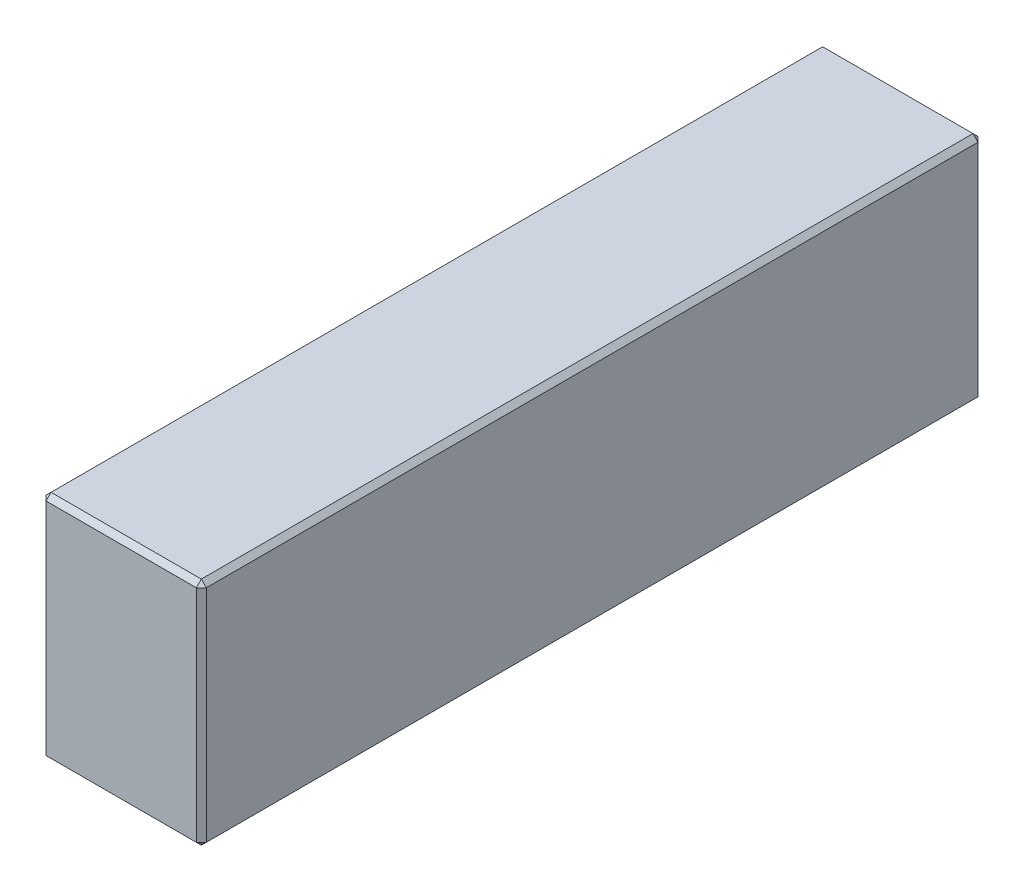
ISO-10303-21;
HEADER;
FILE_DESCRIPTION(('STEP AP214'),'2;1');
FILE_NAME('part.step','',(''),(''),'','','');
FILE_SCHEMA(('AUTOMOTIVE_DESIGN { 1 0 10303 214 1 1 1 1 }'));
ENDSEC;
DATA;
#1=APPLICATION_CONTEXT('core data for automotive mechanical design processes');
#2=APPLICATION_PROTOCOL_DEFINITION('international standard','automotive_design',2000,#1);
#3=PRODUCT_CONTEXT('',#1,'mechanical');
#4=PRODUCT('Part','Part','',(#3));
#5=PRODUCT_RELATED_PRODUCT_CATEGORY('part','',(#4));
#6=PRODUCT_DEFINITION_FORMATION('','',#4);
#7=PRODUCT_DEFINITION_CONTEXT('part definition',#1,'design');
#8=PRODUCT_DEFINITION('design','',#6,#7);
#9=PRODUCT_DEFINITION_SHAPE('','',#8);
#10=(LENGTH_UNIT() NAMED_UNIT(*) SI_UNIT(.MILLI.,.METRE.));
#11=(NAMED_UNIT(*) PLANE_ANGLE_UNIT() SI_UNIT($,.RADIAN.));
#12=(NAMED_UNIT(*) SI_UNIT($,.STERADIAN.) SOLID_ANGLE_UNIT());
#13=UNCERTAINTY_MEASURE_WITH_UNIT(LENGTH_MEASURE(1.E-05),#10,'distance_accuracy_value','');
#14=(GEOMETRIC_REPRESENTATION_CONTEXT(3) GLOBAL_UNCERTAINTY_ASSIGNED_CONTEXT((#13)) GLOBAL_UNIT_ASSIGNED_CONTEXT((#10,
#11,#12)) REPRESENTATION_CONTEXT('',''));
#15=CARTESIAN_POINT('',(0.,0.,0.));
#16=DIRECTION('',(0.,0.,1.));
#17=DIRECTION('',(1.,0.,0.));
#18=AXIS2_PLACEMENT_3D('',#15,#16,#17);
#19=CARTESIAN_POINT('',(-16.,46.,78.));
#20=DIRECTION('',(1.,0.,0.));
#21=DIRECTION('',(0.,0.,-1.));
#22=AXIS2_PLACEMENT_3D('',#19,#20,#21);
#23=PLANE('',#22);
#24=DIRECTION('',(0.,-1.,0.));
#25=VECTOR('',#24,1.);
#26=CARTESIAN_POINT('',(-16.,46.,-77.));
#27=LINE('',#26,#25);
#28=CARTESIAN_POINT('',(-16.,45.,-77.));
#29=VERTEX_POINT('',#28);
#30=CARTESIAN_POINT('',(-16.,1.,-77.));
#31=VERTEX_POINT('',#30);
#32=EDGE_CURVE('E114',#29,#31,#27,.T.);
#33=ORIENTED_EDGE('',*,*,#32,.T.);
#34=DIRECTION('',(0.,0.,1.));
#35=VECTOR('',#34,1.);
#36=CARTESIAN_POINT('',(-16.,1.,78.));
#37=LINE('',#36,#35);
#38=CARTESIAN_POINT('',(-16.,1.,77.));
#39=VERTEX_POINT('',#38);
#40=EDGE_CURVE('E110',#31,#39,#37,.T.);
#41=ORIENTED_EDGE('',*,*,#40,.T.);
#42=DIRECTION('',(0.,1.,0.));
#43=VECTOR('',#42,1.);
#44=CARTESIAN_POINT('',(-16.,46.,77.));
#45=LINE('',#44,#43);
#46=CARTESIAN_POINT('',(-16.,45.,77.));
#47=VERTEX_POINT('',#46);
#48=EDGE_CURVE('E103',#39,#47,#45,.T.);
#49=ORIENTED_EDGE('',*,*,#48,.T.);
#50=DIRECTION('',(0.,0.,-1.));
#51=VECTOR('',#50,1.);
#52=CARTESIAN_POINT('',(-16.,45.,-78.));
#53=LINE('',#52,#51);
#54=EDGE_CURVE('E107',#47,#29,#53,.T.);
#55=ORIENTED_EDGE('',*,*,#54,.T.);
#56=EDGE_LOOP('',(#33,#41,#49,#55));
#57=FACE_BOUND('',#56,.T.);
#58=ADVANCED_FACE('F15',(#57),#23,.F.);
#59=CARTESIAN_POINT('',(16.,46.,78.));
#60=DIRECTION('',(0.,0.,-1.));
#61=DIRECTION('',(-1.,0.,0.));
#62=AXIS2_PLACEMENT_3D('',#59,#60,#61);
#63=PLANE('',#62);
#64=DIRECTION('',(-1.,0.,0.));
#65=VECTOR('',#64,1.);
#66=CARTESIAN_POINT('',(-16.,45.,78.));
#67=LINE('',#66,#65);
#68=CARTESIAN_POINT('',(15.,45.,78.));
#69=VERTEX_POINT('',#68);
#70=CARTESIAN_POINT('',(-15.,45.,78.));
#71=VERTEX_POINT('',#70);
#72=EDGE_CURVE('E164',#69,#71,#67,.T.);
#73=ORIENTED_EDGE('',*,*,#72,.T.);
#74=DIRECTION('',(0.,-1.,0.));
#75=VECTOR('',#74,1.);
#76=CARTESIAN_POINT('',(-15.,46.,78.));
#77=LINE('',#76,#75);
#78=CARTESIAN_POINT('',(-15.,0.999999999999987,78.));
#79=VERTEX_POINT('',#78);
#80=EDGE_CURVE('E122',#71,#79,#77,.T.);
#81=ORIENTED_EDGE('',*,*,#80,.T.);
#82=DIRECTION('',(1.,0.,0.));
#83=VECTOR('',#82,1.);
#84=CARTESIAN_POINT('',(16.,0.999999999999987,78.));
#85=LINE('',#84,#83);
#86=CARTESIAN_POINT('',(15.,0.999999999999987,78.));
#87=VERTEX_POINT('',#86);
#88=EDGE_CURVE('E168',#79,#87,#85,.T.);
#89=ORIENTED_EDGE('',*,*,#88,.T.);
#90=DIRECTION('',(0.,1.,0.));
#91=VECTOR('',#90,1.);
#92=CARTESIAN_POINT('',(15.,46.,78.));
#93=LINE('',#92,#91);
#94=EDGE_CURVE('E166',#87,#69,#93,.T.);
#95=ORIENTED_EDGE('',*,*,#94,.T.);
#96=EDGE_LOOP('',(#73,#81,#89,#95));
#97=FACE_BOUND('',#96,.T.);
#98=ADVANCED_FACE('F275',(#97),#63,.F.);
#99=CARTESIAN_POINT('',(16.,46.,78.));
#100=DIRECTION('',(-1.,0.,0.));
#101=DIRECTION('',(0.,0.,1.));
#102=AXIS2_PLACEMENT_3D('',#99,#100,#101);
#103=PLANE('',#102);
#104=DIRECTION('',(0.,0.,-1.));
#105=VECTOR('',#104,1.);
#106=CARTESIAN_POINT('',(16.,0.999999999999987,78.));
#107=LINE('',#106,#105);
#108=CARTESIAN_POINT('',(16.,0.999999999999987,77.));
#109=VERTEX_POINT('',#108);
#110=CARTESIAN_POINT('',(16.,0.999999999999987,-77.));
#111=VERTEX_POINT('',#110);
#112=EDGE_CURVE('E159',#109,#111,#107,.T.);
#113=ORIENTED_EDGE('',*,*,#112,.T.);
#114=DIRECTION('',(0.,1.,0.));
#115=VECTOR('',#114,1.);
#116=CARTESIAN_POINT('',(16.,46.,-77.));
#117=LINE('',#116,#115);
#118=CARTESIAN_POINT('',(16.,45.,-77.));
#119=VERTEX_POINT('',#118);
#120=EDGE_CURVE('E161',#111,#119,#117,.T.);
#121=ORIENTED_EDGE('',*,*,#120,.T.);
#122=DIRECTION('',(0.,0.,1.));
#123=VECTOR('',#122,1.);
#124=CARTESIAN_POINT('',(16.,45.,78.));
#125=LINE('',#124,#123);
#126=CARTESIAN_POINT('',(16.,45.,77.));
#127=VERTEX_POINT('',#126);
#128=EDGE_CURVE('E155',#119,#127,#125,.T.);
#129=ORIENTED_EDGE('',*,*,#128,.T.);
#130=DIRECTION('',(0.,-1.,0.));
#131=VECTOR('',#130,1.);
#132=CARTESIAN_POINT('',(16.,46.,77.));
#133=LINE('',#132,#131);
#134=EDGE_CURVE('E157',#127,#109,#133,.T.);
#135=ORIENTED_EDGE('',*,*,#134,.T.);
#136=EDGE_LOOP('',(#113,#121,#129,#135));
#137=FACE_BOUND('',#136,.T.);
#138=ADVANCED_FACE('F254',(#137),#103,.F.);
#139=CARTESIAN_POINT('',(16.,46.,-78.));
#140=DIRECTION('',(0.,0.,1.));
#141=DIRECTION('',(1.,0.,0.));
#142=AXIS2_PLACEMENT_3D('',#139,#140,#141);
#143=PLANE('',#142);
#144=DIRECTION('',(0.,-1.,0.));
#145=VECTOR('',#144,1.);
#146=CARTESIAN_POINT('',(15.,46.,-78.));
#147=LINE('',#146,#145);
#148=CARTESIAN_POINT('',(15.,45.,-78.));
#149=VERTEX_POINT('',#148);
#150=CARTESIAN_POINT('',(15.,0.999999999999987,-78.));
#151=VERTEX_POINT('',#150);
#152=EDGE_CURVE('E148',#149,#151,#147,.T.);
#153=ORIENTED_EDGE('',*,*,#152,.T.);
#154=DIRECTION('',(-1.,0.,0.));
#155=VECTOR('',#154,1.);
#156=CARTESIAN_POINT('',(16.,0.999999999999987,-78.));
#157=LINE('',#156,#155);
#158=CARTESIAN_POINT('',(-15.,0.999999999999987,-78.));
#159=VERTEX_POINT('',#158);
#160=EDGE_CURVE('E153',#151,#159,#157,.T.);
#161=ORIENTED_EDGE('',*,*,#160,.T.);
#162=DIRECTION('',(0.,1.,0.));
#163=VECTOR('',#162,1.);
#164=CARTESIAN_POINT('',(-15.,46.,-78.));
#165=LINE('',#164,#163);
#166=CARTESIAN_POINT('',(-15.,45.,-78.));
#167=VERTEX_POINT('',#166);
#168=EDGE_CURVE('E150',#159,#167,#165,.T.);
#169=ORIENTED_EDGE('',*,*,#168,.T.);
#170=DIRECTION('',(1.,0.,0.));
#171=VECTOR('',#170,1.);
#172=CARTESIAN_POINT('',(16.,45.,-78.));
#173=LINE('',#172,#171);
#174=EDGE_CURVE('E146',#167,#149,#173,.T.);
#175=ORIENTED_EDGE('',*,*,#174,.T.);
#176=EDGE_LOOP('',(#153,#161,#169,#175));
#177=FACE_BOUND('',#176,.T.);
#178=ADVANCED_FACE('F284',(#177),#143,.F.);
#179=CARTESIAN_POINT('',(0.,46.,0.));
#180=DIRECTION('',(0.,1.,0.));
#181=DIRECTION('',(0.,0.,1.));
#182=AXIS2_PLACEMENT_3D('',#179,#180,#181);
#183=PLANE('',#182);
#184=DIRECTION('',(0.,0.,-1.));
#185=VECTOR('',#184,1.);
#186=CARTESIAN_POINT('',(15.,46.,-78.));
#187=LINE('',#186,#185);
#188=CARTESIAN_POINT('',(15.,46.,77.));
#189=VERTEX_POINT('',#188);
#190=CARTESIAN_POINT('',(15.,46.,-77.));
#191=VERTEX_POINT('',#190);
#192=EDGE_CURVE('E24',#189,#191,#187,.T.);
#193=ORIENTED_EDGE('',*,*,#192,.T.);
#194=DIRECTION('',(-1.,0.,0.));
#195=VECTOR('',#194,1.);
#196=CARTESIAN_POINT('',(-16.,46.,-77.));
#197=LINE('',#196,#195);
#198=CARTESIAN_POINT('',(-15.,46.,-77.));
#199=VERTEX_POINT('',#198);
#200=EDGE_CURVE('E9',#191,#199,#197,.T.);
#201=ORIENTED_EDGE('',*,*,#200,.T.);
#202=DIRECTION('',(0.,0.,1.));
#203=VECTOR('',#202,1.);
#204=CARTESIAN_POINT('',(-15.,46.,78.));
#205=LINE('',#204,#203);
#206=CARTESIAN_POINT('',(-15.,46.,77.));
#207=VERTEX_POINT('',#206);
#208=EDGE_CURVE('E180',#199,#207,#205,.T.);
#209=ORIENTED_EDGE('',*,*,#208,.T.);
#210=DIRECTION('',(1.,0.,0.));
#211=VECTOR('',#210,1.);
#212=CARTESIAN_POINT('',(16.,46.,77.));
#213=LINE('',#212,#211);
#214=EDGE_CURVE('E35',#207,#189,#213,.T.);
#215=ORIENTED_EDGE('',*,*,#214,.T.);
#216=EDGE_LOOP('',(#193,#201,#209,#215));
#217=FACE_BOUND('',#216,.T.);
#218=ADVANCED_FACE('F350',(#217),#183,.T.);
#219=CARTESIAN_POINT('',(0.,0.,0.));
#220=DIRECTION('',(0.,1.,0.));
#221=DIRECTION('',(0.,0.,1.));
#222=AXIS2_PLACEMENT_3D('',#219,#220,#221);
#223=PLANE('',#222);
#224=DIRECTION('',(0.,0.,1.));
#225=VECTOR('',#224,1.);
#226=CARTESIAN_POINT('',(15.,0.,0.));
#227=LINE('',#226,#225);
#228=CARTESIAN_POINT('',(15.,0.,-77.));
#229=VERTEX_POINT('',#228);
#230=CARTESIAN_POINT('',(15.,0.,77.));
#231=VERTEX_POINT('',#230);
#232=EDGE_CURVE('E171',#229,#231,#227,.T.);
#233=ORIENTED_EDGE('',*,*,#232,.T.);
#234=DIRECTION('',(-1.,0.,0.));
#235=VECTOR('',#234,1.);
#236=CARTESIAN_POINT('',(0.,0.,77.));
#237=LINE('',#236,#235);
#238=CARTESIAN_POINT('',(-15.,0.,77.));
#239=VERTEX_POINT('',#238);
#240=EDGE_CURVE('E177',#231,#239,#237,.T.);
#241=ORIENTED_EDGE('',*,*,#240,.T.);
#242=DIRECTION('',(0.,0.,-1.));
#243=VECTOR('',#242,1.);
#244=CARTESIAN_POINT('',(-15.,0.,0.));
#245=LINE('',#244,#243);
#246=CARTESIAN_POINT('',(-15.,0.,-77.));
#247=VERTEX_POINT('',#246);
#248=EDGE_CURVE('E175',#239,#247,#245,.T.);
#249=ORIENTED_EDGE('',*,*,#248,.T.);
#250=DIRECTION('',(1.,0.,0.));
#251=VECTOR('',#250,1.);
#252=CARTESIAN_POINT('',(0.,0.,-77.));
#253=LINE('',#252,#251);
#254=EDGE_CURVE('E173',#247,#229,#253,.T.);
#255=ORIENTED_EDGE('',*,*,#254,.T.);
#256=EDGE_LOOP('',(#233,#241,#249,#255));
#257=FACE_BOUND('',#256,.T.);
#258=ADVANCED_FACE('F246',(#257),#223,.F.);
#259=CARTESIAN_POINT('',(16.,46.,77.));
#260=DIRECTION('',(-0.707106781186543,0.,-0.707106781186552));
#261=DIRECTION('',(0.,-1.,0.));
#262=AXIS2_PLACEMENT_3D('',#259,#260,#261);
#263=PLANE('',#262);
#264=DIRECTION('',(-0.707106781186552,0.,0.707106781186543));
#265=VECTOR('',#264,1.);
#266=CARTESIAN_POINT('',(15.,45.,78.));
#267=LINE('',#266,#265);
#268=EDGE_CURVE('E19',#69,#127,#267,.F.);
#269=ORIENTED_EDGE('',*,*,#268,.F.);
#270=ORIENTED_EDGE('',*,*,#94,.F.);
#271=DIRECTION('',(0.707106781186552,0.,-0.707106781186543));
#272=VECTOR('',#271,1.);
#273=CARTESIAN_POINT('',(15.,0.999999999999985,78.));
#274=LINE('',#273,#272);
#275=EDGE_CURVE('E142',#109,#87,#274,.F.);
#276=ORIENTED_EDGE('',*,*,#275,.F.);
#277=ORIENTED_EDGE('',*,*,#134,.F.);
#278=EDGE_LOOP('',(#269,#270,#276,#277));
#279=FACE_BOUND('',#278,.T.);
#280=ADVANCED_FACE('F17',(#279),#263,.F.);
#281=CARTESIAN_POINT('',(15.,45.,78.));
#282=DIRECTION('',(0.577350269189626,0.577350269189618,0.577350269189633));
#283=DIRECTION('',(0.707106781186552,0.,-0.707106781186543));
#284=AXIS2_PLACEMENT_3D('',#281,#282,#283);
#285=PLANE('',#284);
#286=DIRECTION('',(0.,-0.707106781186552,0.707106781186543));
#287=VECTOR('',#286,1.);
#288=CARTESIAN_POINT('',(15.,45.,78.));
#289=LINE('',#288,#287);
#290=EDGE_CURVE('E226',#69,#189,#289,.F.);
#291=ORIENTED_EDGE('',*,*,#290,.F.);
#292=ORIENTED_EDGE('',*,*,#268,.T.);
#293=DIRECTION('',(-0.707106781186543,0.707106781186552,0.));
#294=VECTOR('',#293,1.);
#295=CARTESIAN_POINT('',(15.5,45.5,77.));
#296=LINE('',#295,#294);
#297=EDGE_CURVE('E228',#189,#127,#296,.F.);
#298=ORIENTED_EDGE('',*,*,#297,.F.);
#299=EDGE_LOOP('',(#291,#292,#298));
#300=FACE_BOUND('',#299,.T.);
#301=ADVANCED_FACE('F270',(#300),#285,.T.);
#302=CARTESIAN_POINT('',(15.,0.999999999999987,78.));
#303=DIRECTION('',(0.577350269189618,-0.577350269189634,0.577350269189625));
#304=DIRECTION('',(0.,-0.707106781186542,-0.707106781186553));
#305=AXIS2_PLACEMENT_3D('',#302,#303,#304);
#306=PLANE('',#305);
#307=DIRECTION('',(-0.707106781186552,-0.707106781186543,0.));
#308=VECTOR('',#307,1.);
#309=CARTESIAN_POINT('',(15.5,0.499999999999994,77.));
#310=LINE('',#309,#308);
#311=EDGE_CURVE('E220',#109,#231,#310,.T.);
#312=ORIENTED_EDGE('',*,*,#311,.F.);
#313=ORIENTED_EDGE('',*,*,#275,.T.);
#314=DIRECTION('',(0.,0.707106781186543,0.707106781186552));
#315=VECTOR('',#314,1.);
#316=CARTESIAN_POINT('',(15.,0.999999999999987,78.));
#317=LINE('',#316,#315);
#318=EDGE_CURVE('E223',#231,#87,#317,.T.);
#319=ORIENTED_EDGE('',*,*,#318,.F.);
#320=EDGE_LOOP('',(#312,#313,#319));
#321=FACE_BOUND('',#320,.T.);
#322=ADVANCED_FACE('F235',(#321),#306,.T.);
#323=CARTESIAN_POINT('',(15.,46.,0.));
#324=DIRECTION('',(0.707106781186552,0.707106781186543,0.));
#325=DIRECTION('',(0.,0.,1.));
#326=AXIS2_PLACEMENT_3D('',#323,#324,#325);
#327=PLANE('',#326);
#328=ORIENTED_EDGE('',*,*,#297,.T.);
#329=ORIENTED_EDGE('',*,*,#128,.F.);
#330=DIRECTION('',(0.707106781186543,-0.707106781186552,0.));
#331=VECTOR('',#330,1.);
#332=CARTESIAN_POINT('',(16.,45.,-77.));
#333=LINE('',#332,#331);
#334=EDGE_CURVE('E215',#191,#119,#333,.T.);
#335=ORIENTED_EDGE('',*,*,#334,.F.);
#336=ORIENTED_EDGE('',*,*,#192,.F.);
#337=EDGE_LOOP('',(#328,#329,#335,#336));
#338=FACE_BOUND('',#337,.T.);
#339=ADVANCED_FACE('F265',(#338),#327,.T.);
#340=CARTESIAN_POINT('',(0.,46.,77.));
#341=DIRECTION('',(0.,0.707106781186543,0.707106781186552));
#342=DIRECTION('',(-1.,0.,0.));
#343=AXIS2_PLACEMENT_3D('',#340,#341,#342);
#344=PLANE('',#343);
#345=ORIENTED_EDGE('',*,*,#290,.T.);
#346=ORIENTED_EDGE('',*,*,#214,.F.);
#347=DIRECTION('',(0.,0.707106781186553,-0.707106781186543));
#348=VECTOR('',#347,1.);
#349=CARTESIAN_POINT('',(-15.,45.5,77.5));
#350=LINE('',#349,#348);
#351=EDGE_CURVE('E126',#71,#207,#350,.T.);
#352=ORIENTED_EDGE('',*,*,#351,.F.);
#353=ORIENTED_EDGE('',*,*,#72,.F.);
#354=EDGE_LOOP('',(#345,#346,#352,#353));
#355=FACE_BOUND('',#354,.T.);
#356=ADVANCED_FACE('F273',(#355),#344,.T.);
#357=CARTESIAN_POINT('',(-15.,46.,78.));
#358=DIRECTION('',(0.707106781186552,0.,-0.707106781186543));
#359=DIRECTION('',(0.,-1.,0.));
#360=AXIS2_PLACEMENT_3D('',#357,#358,#359);
#361=PLANE('',#360);
#362=DIRECTION('',(0.707106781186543,0.,0.707106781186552));
#363=VECTOR('',#362,1.);
#364=CARTESIAN_POINT('',(-15.,0.999999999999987,78.));
#365=LINE('',#364,#363);
#366=EDGE_CURVE('E127',#79,#39,#365,.F.);
#367=ORIENTED_EDGE('',*,*,#366,.F.);
#368=ORIENTED_EDGE('',*,*,#80,.F.);
#369=DIRECTION('',(-0.707106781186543,0.,-0.707106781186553));
#370=VECTOR('',#369,1.);
#371=CARTESIAN_POINT('',(-16.,45.,77.));
#372=LINE('',#371,#370);
#373=EDGE_CURVE('E118',#47,#71,#372,.F.);
#374=ORIENTED_EDGE('',*,*,#373,.F.);
#375=ORIENTED_EDGE('',*,*,#48,.F.);
#376=EDGE_LOOP('',(#367,#368,#374,#375));
#377=FACE_BOUND('',#376,.T.);
#378=ADVANCED_FACE('F120',(#377),#361,.F.);
#379=CARTESIAN_POINT('',(16.,0.999999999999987,78.));
#380=DIRECTION('',(0.,0.707106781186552,-0.707106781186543));
#381=DIRECTION('',(1.,0.,0.));
#382=AXIS2_PLACEMENT_3D('',#379,#380,#381);
#383=PLANE('',#382);
#384=ORIENTED_EDGE('',*,*,#318,.T.);
#385=ORIENTED_EDGE('',*,*,#88,.F.);
#386=DIRECTION('',(0.,-0.707106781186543,-0.707106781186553));
#387=VECTOR('',#386,1.);
#388=CARTESIAN_POINT('',(-15.,0.999999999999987,78.));
#389=LINE('',#388,#387);
#390=EDGE_CURVE('E211',#239,#79,#389,.F.);
#391=ORIENTED_EDGE('',*,*,#390,.F.);
#392=ORIENTED_EDGE('',*,*,#240,.F.);
#393=EDGE_LOOP('',(#384,#385,#391,#392));
#394=FACE_BOUND('',#393,.T.);
#395=ADVANCED_FACE('F243',(#394),#383,.F.);
#396=CARTESIAN_POINT('',(16.,0.999999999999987,78.));
#397=DIRECTION('',(-0.707106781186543,0.707106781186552,0.));
#398=DIRECTION('',(0.,0.,-1.));
#399=AXIS2_PLACEMENT_3D('',#396,#397,#398);
#400=PLANE('',#399);
#401=ORIENTED_EDGE('',*,*,#311,.T.);
#402=ORIENTED_EDGE('',*,*,#232,.F.);
#403=DIRECTION('',(0.707106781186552,0.707106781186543,0.));
#404=VECTOR('',#403,1.);
#405=CARTESIAN_POINT('',(15.5,0.5,-77.));
#406=LINE('',#405,#404);
#407=EDGE_CURVE('E208',#111,#229,#406,.F.);
#408=ORIENTED_EDGE('',*,*,#407,.F.);
#409=ORIENTED_EDGE('',*,*,#112,.F.);
#410=EDGE_LOOP('',(#401,#402,#408,#409));
#411=FACE_BOUND('',#410,.T.);
#412=ADVANCED_FACE('F251',(#411),#400,.F.);
#413=CARTESIAN_POINT('',(15.,46.,-78.));
#414=DIRECTION('',(-0.707106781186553,0.,0.707106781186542));
#415=DIRECTION('',(0.,-1.,0.));
#416=AXIS2_PLACEMENT_3D('',#413,#414,#415);
#417=PLANE('',#416);
#418=DIRECTION('',(0.707106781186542,0.,0.707106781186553));
#419=VECTOR('',#418,1.);
#420=CARTESIAN_POINT('',(16.,45.,-77.));
#421=LINE('',#420,#419);
#422=EDGE_CURVE('E217',#119,#149,#421,.F.);
#423=ORIENTED_EDGE('',*,*,#422,.F.);
#424=ORIENTED_EDGE('',*,*,#120,.F.);
#425=DIRECTION('',(-0.707106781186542,0.,-0.707106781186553));
#426=VECTOR('',#425,1.);
#427=CARTESIAN_POINT('',(15.,0.999999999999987,-78.));
#428=LINE('',#427,#426);
#429=EDGE_CURVE('E205',#151,#111,#428,.F.);
#430=ORIENTED_EDGE('',*,*,#429,.F.);
#431=ORIENTED_EDGE('',*,*,#152,.F.);
#432=EDGE_LOOP('',(#423,#424,#430,#431));
#433=FACE_BOUND('',#432,.T.);
#434=ADVANCED_FACE('F258',(#433),#417,.F.);
#435=CARTESIAN_POINT('',(16.,45.,-77.));
#436=DIRECTION('',(0.577350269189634,0.577350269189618,-0.577350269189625));
#437=DIRECTION('',(-0.707106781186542,0.,-0.707106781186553));
#438=AXIS2_PLACEMENT_3D('',#435,#436,#437);
#439=PLANE('',#438);
#440=ORIENTED_EDGE('',*,*,#334,.T.);
#441=ORIENTED_EDGE('',*,*,#422,.T.);
#442=DIRECTION('',(0.,0.707106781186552,0.707106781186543));
#443=VECTOR('',#442,1.);
#444=CARTESIAN_POINT('',(15.,45.5,-77.5));
#445=LINE('',#444,#443);
#446=EDGE_CURVE('E134',#191,#149,#445,.F.);
#447=ORIENTED_EDGE('',*,*,#446,.F.);
#448=EDGE_LOOP('',(#440,#441,#447));
#449=FACE_BOUND('',#448,.T.);
#450=ADVANCED_FACE('F325',(#449),#439,.T.);
#451=CARTESIAN_POINT('',(-16.,45.,77.));
#452=DIRECTION('',(-0.577350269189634,0.577350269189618,0.577350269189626));
#453=DIRECTION('',(0.707106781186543,0.,0.707106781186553));
#454=AXIS2_PLACEMENT_3D('',#451,#452,#453);
#455=PLANE('',#454);
#456=ORIENTED_EDGE('',*,*,#373,.T.);
#457=ORIENTED_EDGE('',*,*,#351,.T.);
#458=DIRECTION('',(-0.707106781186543,-0.707106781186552,0.));
#459=VECTOR('',#458,1.);
#460=CARTESIAN_POINT('',(-16.,45.,77.));
#461=LINE('',#460,#459);
#462=EDGE_CURVE('E130',#47,#207,#461,.F.);
#463=ORIENTED_EDGE('',*,*,#462,.F.);
#464=EDGE_LOOP('',(#456,#457,#463));
#465=FACE_BOUND('',#464,.T.);
#466=ADVANCED_FACE('F131',(#465),#455,.T.);
#467=CARTESIAN_POINT('',(-15.,0.999999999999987,78.));
#468=DIRECTION('',(-0.577350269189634,-0.577350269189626,0.577350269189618));
#469=DIRECTION('',(0.707106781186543,-0.707106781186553,0.));
#470=AXIS2_PLACEMENT_3D('',#467,#468,#469);
#471=PLANE('',#470);
#472=ORIENTED_EDGE('',*,*,#390,.T.);
#473=ORIENTED_EDGE('',*,*,#366,.T.);
#474=DIRECTION('',(-0.707106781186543,0.707106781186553,0.));
#475=VECTOR('',#474,1.);
#476=CARTESIAN_POINT('',(-15.5,0.5,77.));
#477=LINE('',#476,#475);
#478=EDGE_CURVE('E135',#239,#39,#477,.T.);
#479=ORIENTED_EDGE('',*,*,#478,.F.);
#480=EDGE_LOOP('',(#472,#473,#479));
#481=FACE_BOUND('',#480,.T.);
#482=ADVANCED_FACE('F318',(#481),#471,.T.);
#483=CARTESIAN_POINT('',(15.,0.999999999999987,-78.));
#484=DIRECTION('',(0.577350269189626,-0.577350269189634,-0.577350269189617));
#485=DIRECTION('',(0.707106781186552,0.707106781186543,0.));
#486=AXIS2_PLACEMENT_3D('',#483,#484,#485);
#487=PLANE('',#486);
#488=ORIENTED_EDGE('',*,*,#429,.T.);
#489=ORIENTED_EDGE('',*,*,#407,.T.);
#490=DIRECTION('',(0.,-0.707106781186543,0.707106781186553));
#491=VECTOR('',#490,1.);
#492=CARTESIAN_POINT('',(15.,0.999999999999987,-78.));
#493=LINE('',#492,#491);
#494=EDGE_CURVE('E198',#151,#229,#493,.T.);
#495=ORIENTED_EDGE('',*,*,#494,.F.);
#496=EDGE_LOOP('',(#488,#489,#495));
#497=FACE_BOUND('',#496,.T.);
#498=ADVANCED_FACE('F314',(#497),#487,.T.);
#499=CARTESIAN_POINT('',(0.,46.,-77.));
#500=DIRECTION('',(0.,0.707106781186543,-0.707106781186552));
#501=DIRECTION('',(1.,0.,0.));
#502=AXIS2_PLACEMENT_3D('',#499,#500,#501);
#503=PLANE('',#502);
#504=ORIENTED_EDGE('',*,*,#446,.T.);
#505=ORIENTED_EDGE('',*,*,#174,.F.);
#506=DIRECTION('',(0.,-0.707106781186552,-0.707106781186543));
#507=VECTOR('',#506,1.);
#508=CARTESIAN_POINT('',(-15.,45.,-78.));
#509=LINE('',#508,#507);
#510=EDGE_CURVE('E195',#199,#167,#509,.T.);
#511=ORIENTED_EDGE('',*,*,#510,.F.);
#512=ORIENTED_EDGE('',*,*,#200,.F.);
#513=EDGE_LOOP('',(#504,#505,#511,#512));
#514=FACE_BOUND('',#513,.T.);
#515=ADVANCED_FACE('F311',(#514),#503,.T.);
#516=CARTESIAN_POINT('',(-15.,46.,0.));
#517=DIRECTION('',(-0.707106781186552,0.707106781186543,0.));
#518=DIRECTION('',(0.,0.,-1.));
#519=AXIS2_PLACEMENT_3D('',#516,#517,#518);
#520=PLANE('',#519);
#521=ORIENTED_EDGE('',*,*,#462,.T.);
#522=ORIENTED_EDGE('',*,*,#208,.F.);
#523=DIRECTION('',(0.707106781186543,0.707106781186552,0.));
#524=VECTOR('',#523,1.);
#525=CARTESIAN_POINT('',(-15.5,45.5,-77.));
#526=LINE('',#525,#524);
#527=EDGE_CURVE('E138',#29,#199,#526,.T.);
#528=ORIENTED_EDGE('',*,*,#527,.F.);
#529=ORIENTED_EDGE('',*,*,#54,.F.);
#530=EDGE_LOOP('',(#521,#522,#528,#529));
#531=FACE_BOUND('',#530,.T.);
#532=ADVANCED_FACE('F137',(#531),#520,.T.);
#533=CARTESIAN_POINT('',(-16.,1.,78.));
#534=DIRECTION('',(0.707106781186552,0.707106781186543,0.));
#535=DIRECTION('',(0.,0.,1.));
#536=AXIS2_PLACEMENT_3D('',#533,#534,#535);
#537=PLANE('',#536);
#538=ORIENTED_EDGE('',*,*,#478,.T.);
#539=ORIENTED_EDGE('',*,*,#40,.F.);
#540=DIRECTION('',(0.707106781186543,-0.707106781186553,0.));
#541=VECTOR('',#540,1.);
#542=CARTESIAN_POINT('',(-16.,1.,-77.));
#543=LINE('',#542,#541);
#544=EDGE_CURVE('E191',#247,#31,#543,.F.);
#545=ORIENTED_EDGE('',*,*,#544,.F.);
#546=ORIENTED_EDGE('',*,*,#248,.F.);
#547=EDGE_LOOP('',(#538,#539,#545,#546));
#548=FACE_BOUND('',#547,.T.);
#549=ADVANCED_FACE('F304',(#548),#537,.F.);
#550=CARTESIAN_POINT('',(16.,0.999999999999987,-78.));
#551=DIRECTION('',(0.,0.707106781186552,0.707106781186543));
#552=DIRECTION('',(-1.,0.,0.));
#553=AXIS2_PLACEMENT_3D('',#550,#551,#552);
#554=PLANE('',#553);
#555=ORIENTED_EDGE('',*,*,#494,.T.);
#556=ORIENTED_EDGE('',*,*,#254,.F.);
#557=DIRECTION('',(0.,0.707106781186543,-0.707106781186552));
#558=VECTOR('',#557,1.);
#559=CARTESIAN_POINT('',(-15.,0.499999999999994,-77.5));
#560=LINE('',#559,#558);
#561=EDGE_CURVE('E188',#159,#247,#560,.F.);
#562=ORIENTED_EDGE('',*,*,#561,.F.);
#563=ORIENTED_EDGE('',*,*,#160,.F.);
#564=EDGE_LOOP('',(#555,#556,#562,#563));
#565=FACE_BOUND('',#564,.T.);
#566=ADVANCED_FACE('F300',(#565),#554,.F.);
#567=CARTESIAN_POINT('',(-15.,45.,-78.));
#568=DIRECTION('',(-0.577350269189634,0.577350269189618,-0.577350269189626));
#569=DIRECTION('',(-0.707106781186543,0.,0.707106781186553));
#570=AXIS2_PLACEMENT_3D('',#567,#568,#569);
#571=PLANE('',#570);
#572=ORIENTED_EDGE('',*,*,#527,.T.);
#573=ORIENTED_EDGE('',*,*,#510,.T.);
#574=DIRECTION('',(0.707106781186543,0.,-0.707106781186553));
#575=VECTOR('',#574,1.);
#576=CARTESIAN_POINT('',(-15.,45.,-78.));
#577=LINE('',#576,#575);
#578=EDGE_CURVE('E186',#29,#167,#577,.T.);
#579=ORIENTED_EDGE('',*,*,#578,.F.);
#580=EDGE_LOOP('',(#572,#573,#579));
#581=FACE_BOUND('',#580,.T.);
#582=ADVANCED_FACE('F296',(#581),#571,.T.);
#583=CARTESIAN_POINT('',(-16.,1.,-77.));
#584=DIRECTION('',(-0.577350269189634,-0.577350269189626,-0.577350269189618));
#585=DIRECTION('',(0.707106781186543,-0.707106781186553,0.));
#586=AXIS2_PLACEMENT_3D('',#583,#584,#585);
#587=PLANE('',#586);
#588=ORIENTED_EDGE('',*,*,#561,.T.);
#589=ORIENTED_EDGE('',*,*,#544,.T.);
#590=DIRECTION('',(-0.707106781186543,0.,0.707106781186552));
#591=VECTOR('',#590,1.);
#592=CARTESIAN_POINT('',(-16.,1.,-77.));
#593=LINE('',#592,#591);
#594=EDGE_CURVE('E184',#159,#31,#593,.T.);
#595=ORIENTED_EDGE('',*,*,#594,.F.);
#596=EDGE_LOOP('',(#588,#589,#595));
#597=FACE_BOUND('',#596,.T.);
#598=ADVANCED_FACE('F292',(#597),#587,.T.);
#599=CARTESIAN_POINT('',(-16.,46.,-77.));
#600=DIRECTION('',(0.707106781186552,0.,0.707106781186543));
#601=DIRECTION('',(0.,-1.,0.));
#602=AXIS2_PLACEMENT_3D('',#599,#600,#601);
#603=PLANE('',#602);
#604=ORIENTED_EDGE('',*,*,#578,.T.);
#605=ORIENTED_EDGE('',*,*,#168,.F.);
#606=ORIENTED_EDGE('',*,*,#594,.T.);
#607=ORIENTED_EDGE('',*,*,#32,.F.);
#608=EDGE_LOOP('',(#604,#605,#606,#607));
#609=FACE_BOUND('',#608,.T.);
#610=ADVANCED_FACE('F289',(#609),#603,.F.);
#611=CLOSED_SHELL('',(#58,#98,#138,#178,#218,#258,#280,#301,#322,#339,#356,#378,#395,#412,#434,
#450,#466,#482,#498,#515,#532,#549,#566,#582,#598,#610));
#612=MANIFOLD_SOLID_BREP('B1',#611);
#613=ADVANCED_BREP_SHAPE_REPRESENTATION('',(#18,#612),#14);
#614=SHAPE_DEFINITION_REPRESENTATION(#9,#613);
ENDSEC;
END-ISO-10303-21;
